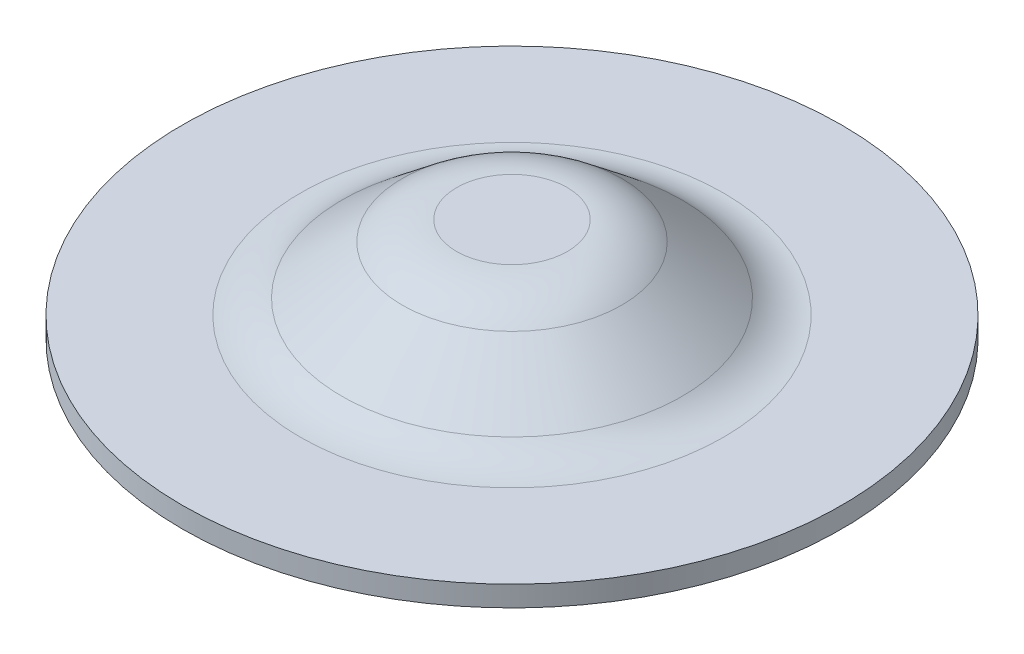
ISO-10303-21;
HEADER;
FILE_DESCRIPTION(('STEP AP214'),'2;1');
FILE_NAME('part.step','',(''),(''),'','','');
FILE_SCHEMA(('AUTOMOTIVE_DESIGN { 1 0 10303 214 1 1 1 1 }'));
ENDSEC;
DATA;
#1=APPLICATION_CONTEXT('core data for automotive mechanical design processes');
#2=APPLICATION_PROTOCOL_DEFINITION('international standard','automotive_design',2000,#1);
#3=PRODUCT_CONTEXT('',#1,'mechanical');
#4=PRODUCT('Part','Part','',(#3));
#5=PRODUCT_RELATED_PRODUCT_CATEGORY('part','',(#4));
#6=PRODUCT_DEFINITION_FORMATION('','',#4);
#7=PRODUCT_DEFINITION_CONTEXT('part definition',#1,'design');
#8=PRODUCT_DEFINITION('design','',#6,#7);
#9=PRODUCT_DEFINITION_SHAPE('','',#8);
#10=(LENGTH_UNIT() NAMED_UNIT(*) SI_UNIT(.MILLI.,.METRE.));
#11=(NAMED_UNIT(*) PLANE_ANGLE_UNIT() SI_UNIT($,.RADIAN.));
#12=(NAMED_UNIT(*) SI_UNIT($,.STERADIAN.) SOLID_ANGLE_UNIT());
#13=UNCERTAINTY_MEASURE_WITH_UNIT(LENGTH_MEASURE(1.E-05),#10,'distance_accuracy_value','');
#14=(GEOMETRIC_REPRESENTATION_CONTEXT(3) GLOBAL_UNCERTAINTY_ASSIGNED_CONTEXT((#13)) GLOBAL_UNIT_ASSIGNED_CONTEXT((#10,
#11,#12)) REPRESENTATION_CONTEXT('',''));
#15=CARTESIAN_POINT('',(0.,0.,0.));
#16=DIRECTION('',(0.,0.,1.));
#17=DIRECTION('',(1.,0.,0.));
#18=AXIS2_PLACEMENT_3D('',#15,#16,#17);
#19=CARTESIAN_POINT('',(0.,0.,0.));
#20=DIRECTION('',(0.,-1.,0.));
#21=DIRECTION('',(0.,0.,-1.));
#22=AXIS2_PLACEMENT_3D('',#19,#20,#21);
#23=PLANE('',#22);
#24=CARTESIAN_POINT('',(0.,0.,-2.667));
#25=CARTESIAN_POINT('',(0.0290924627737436,0.,-2.66700018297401));
#26=CARTESIAN_POINT('',(0.058184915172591,0.,-2.6665239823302));
#27=CARTESIAN_POINT('',(0.116338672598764,0.,-2.66462012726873));
#28=CARTESIAN_POINT('',(0.145399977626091,0.,-2.66319247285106));
#29=CARTESIAN_POINT('',(0.203460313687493,0.,-2.65938702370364));
#30=CARTESIAN_POINT('',(0.23245934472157,0.,-2.65700922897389));
#31=CARTESIAN_POINT('',(0.290364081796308,0.,-2.65130610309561));
#32=CARTESIAN_POINT('',(0.31926978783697,0.,-2.64798077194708));
#33=CARTESIAN_POINT('',(0.376956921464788,0.,-2.64038611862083));
#34=CARTESIAN_POINT('',(0.405738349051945,0.,-2.63611679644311));
#35=CARTESIAN_POINT('',(0.463146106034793,0.,-2.62663873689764));
#36=CARTESIAN_POINT('',(0.491772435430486,0.,-2.62142999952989));
#37=CARTESIAN_POINT('',(0.548839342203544,0.,-2.61007868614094));
#38=CARTESIAN_POINT('',(0.57727991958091,0.,-2.60393611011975));
#39=CARTESIAN_POINT('',(0.633944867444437,0.,-2.59072369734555));
#40=CARTESIAN_POINT('',(0.662169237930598,0.,-2.58365386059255));
#41=CARTESIAN_POINT('',(0.718371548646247,0.,-2.56859449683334));
#42=CARTESIAN_POINT('',(0.746349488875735,0.,-2.56060496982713));
#43=CARTESIAN_POINT('',(0.802028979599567,0.,-2.54371478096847));
#44=CARTESIAN_POINT('',(0.82973053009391,0.,-2.53481411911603));
#45=CARTESIAN_POINT('',(0.88482757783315,0.,-2.51611119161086));
#46=CARTESIAN_POINT('',(0.912223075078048,0.,-2.50630892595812));
#47=CARTESIAN_POINT('',(0.966678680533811,0.,-2.48581328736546));
#48=CARTESIAN_POINT('',(0.993738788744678,0.,-2.47511991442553));
#49=CARTESIAN_POINT('',(1.04749463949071,0.,-2.45285351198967));
#50=CARTESIAN_POINT('',(1.07419038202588,0.,-2.44128048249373));
#51=CARTESIAN_POINT('',(1.12718891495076,0.,-2.41726715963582));
#52=CARTESIAN_POINT('',(1.15349170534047,0.,-2.40482686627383));
#53=CARTESIAN_POINT('',(1.20567616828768,0.,-2.37909233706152));
#54=CARTESIAN_POINT('',(1.23155784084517,0.,-2.36579810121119));
#55=CARTESIAN_POINT('',(1.2828723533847,0.,-2.33836992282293));
#56=CARTESIAN_POINT('',(1.30830519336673,0.,-2.32423598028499));
#57=CARTESIAN_POINT('',(1.35869480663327,0.,-2.2951435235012));
#58=CARTESIAN_POINT('',(1.38365157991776,0.,-2.28018500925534));
#59=CARTESIAN_POINT('',(1.4330623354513,0.,-2.24945942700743));
#60=CARTESIAN_POINT('',(1.45751631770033,0.,-2.23369235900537));
#61=CARTESIAN_POINT('',(1.50589530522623,0.,-2.2013665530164));
#62=CARTESIAN_POINT('',(1.5298203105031,0.,-2.18480781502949));
#63=CARTESIAN_POINT('',(1.57711572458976,0.,-2.15091640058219));
#64=CARTESIAN_POINT('',(1.60048613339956,0.,-2.1335837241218));
#65=CARTESIAN_POINT('',(1.64664732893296,0.,-2.09816299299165));
#66=CARTESIAN_POINT('',(1.66943811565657,0.,-2.08007493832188));
#67=CARTESIAN_POINT('',(1.71441566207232,0.,-2.04316281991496));
#68=CARTESIAN_POINT('',(1.73660242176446,0.,-2.02433875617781));
#69=CARTESIAN_POINT('',(1.7803481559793,0.,-1.98597477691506));
#70=CARTESIAN_POINT('',(1.80190713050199,0.,-1.96643486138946));
#71=CARTESIAN_POINT('',(1.844374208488,0.,-1.92666010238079));
#72=CARTESIAN_POINT('',(1.86528231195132,0.,-1.90642525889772));
#73=CARTESIAN_POINT('',(1.90642525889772,0.,-1.86528231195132));
#74=CARTESIAN_POINT('',(1.92666010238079,0.,-1.844374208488));
#75=CARTESIAN_POINT('',(1.96643486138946,0.,-1.80190713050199));
#76=CARTESIAN_POINT('',(1.98597477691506,0.,-1.7803481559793));
#77=CARTESIAN_POINT('',(2.02433875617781,0.,-1.73660242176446));
#78=CARTESIAN_POINT('',(2.04316281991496,0.,-1.71441566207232));
#79=CARTESIAN_POINT('',(2.08007493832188,0.,-1.66943811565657));
#80=CARTESIAN_POINT('',(2.09816299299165,0.,-1.64664732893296));
#81=CARTESIAN_POINT('',(2.1335837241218,0.,-1.60048613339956));
#82=CARTESIAN_POINT('',(2.15091640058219,0.,-1.57711572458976));
#83=CARTESIAN_POINT('',(2.18480781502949,0.,-1.5298203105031));
#84=CARTESIAN_POINT('',(2.2013665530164,0.,-1.50589530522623));
#85=CARTESIAN_POINT('',(2.23369235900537,0.,-1.45751631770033));
#86=CARTESIAN_POINT('',(2.24945942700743,0.,-1.4330623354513));
#87=CARTESIAN_POINT('',(2.28018500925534,0.,-1.38365157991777));
#88=CARTESIAN_POINT('',(2.2951435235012,0.,-1.35869480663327));
#89=CARTESIAN_POINT('',(2.32423598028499,0.,-1.30830519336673));
#90=CARTESIAN_POINT('',(2.33836992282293,0.,-1.2828723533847));
#91=CARTESIAN_POINT('',(2.36579810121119,0.,-1.23155784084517));
#92=CARTESIAN_POINT('',(2.37909233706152,0.,-1.20567616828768));
#93=CARTESIAN_POINT('',(2.40482686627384,0.,-1.15349170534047));
#94=CARTESIAN_POINT('',(2.41726715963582,0.,-1.12718891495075));
#95=CARTESIAN_POINT('',(2.44128048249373,0.,-1.07419038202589));
#96=CARTESIAN_POINT('',(2.45285351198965,0.,-1.04749463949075));
#97=CARTESIAN_POINT('',(2.47511991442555,0.,-0.993738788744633));
#98=CARTESIAN_POINT('',(2.48581328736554,0.,-0.966678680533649));
#99=CARTESIAN_POINT('',(2.50630892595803,0.,-0.912223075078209));
#100=CARTESIAN_POINT('',(2.51611119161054,0.,-0.884827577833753));
#101=CARTESIAN_POINT('',(2.53481411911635,0.,-0.829730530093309));
#102=CARTESIAN_POINT('',(2.54371478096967,0.,-0.802028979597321));
#103=CARTESIAN_POINT('',(2.56060496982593,0.,-0.74634948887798));
#104=CARTESIAN_POINT('',(2.56859449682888,0.,-0.718371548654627));
#105=CARTESIAN_POINT('',(2.58365386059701,0.,-0.662169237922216));
#106=CARTESIAN_POINT('',(2.59072369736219,0.,-0.633944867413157));
#107=CARTESIAN_POINT('',(2.6039361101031,0.,-0.577279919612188));
#108=CARTESIAN_POINT('',(2.61007868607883,0.,-0.548839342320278));
#109=CARTESIAN_POINT('',(2.62142999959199,0.,-0.49177243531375));
#110=CARTESIAN_POINT('',(2.62663873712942,0.,-0.463146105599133));
#111=CARTESIAN_POINT('',(2.63611679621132,0.,-0.405738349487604));
#112=CARTESIAN_POINT('',(2.64038611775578,0.,-0.376956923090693));
#113=CARTESIAN_POINT('',(2.64798077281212,0.,-0.319269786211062));
#114=CARTESIAN_POINT('',(2.651306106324,0.,-0.290364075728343));
#115=CARTESIAN_POINT('',(2.6570092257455,0.,-0.232459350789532));
#116=CARTESIAN_POINT('',(2.65938701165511,0.,-0.203460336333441));
#117=CARTESIAN_POINT('',(2.6631924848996,0.,-0.145399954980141));
#118=CARTESIAN_POINT('',(2.66462017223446,0.,-0.116338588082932));
#119=CARTESIAN_POINT('',(2.66652393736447,0.,-0.0581849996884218));
#120=CARTESIAN_POINT('',(2.66700001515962,0.,-0.0290927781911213));
#121=CARTESIAN_POINT('',(2.66699998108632,0.,0.0362971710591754));
#122=CARTESIAN_POINT('',(2.66625887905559,0.,0.0725952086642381));
#123=CARTESIAN_POINT('',(2.66329566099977,0.,0.145130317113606));
#124=CARTESIAN_POINT('',(2.66107354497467,0.,0.181367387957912));
#125=CARTESIAN_POINT('',(2.65515202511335,0.,0.253720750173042));
#126=CARTESIAN_POINT('',(2.65145262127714,0.,0.289837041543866));
#127=CARTESIAN_POINT('',(2.64258268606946,0.,0.361888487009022));
#128=CARTESIAN_POINT('',(2.63741215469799,0.,0.397823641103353));
#129=CARTESIAN_POINT('',(2.62560858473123,0.,0.46945295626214));
#130=CARTESIAN_POINT('',(2.61897554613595,0.,0.505147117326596));
#131=CARTESIAN_POINT('',(2.60425801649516,0.,0.576234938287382));
#132=CARTESIAN_POINT('',(2.59617352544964,0.,0.611628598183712));
#133=CARTESIAN_POINT('',(2.57856657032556,0.,0.682056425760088));
#134=CARTESIAN_POINT('',(2.569044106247,0.,0.717090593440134));
#135=CARTESIAN_POINT('',(2.54857706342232,0.,0.786741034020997));
#136=CARTESIAN_POINT('',(2.5376324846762,0.,0.821357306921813));
#137=CARTESIAN_POINT('',(2.51433950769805,0.,0.890114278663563));
#138=CARTESIAN_POINT('',(2.50199110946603,1.35107511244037E-13,0.924254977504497));
#139=CARTESIAN_POINT('',(2.47591088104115,-1.35107511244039E-13,0.992003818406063));
#140=CARTESIAN_POINT('',(2.46217905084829,-5.04228096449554E-13,1.0256119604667));
#141=CARTESIAN_POINT('',(2.43335557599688,5.04228096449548E-13,1.09223995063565));
#142=CARTESIAN_POINT('',(2.41826393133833,1.88180487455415E-12,1.12525979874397));
#143=CARTESIAN_POINT('',(2.38674326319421,-1.88180487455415E-12,1.19065510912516));
#144=CARTESIAN_POINT('',(2.37031423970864,-7.02299140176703E-12,1.22303057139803));
#145=CARTESIAN_POINT('',(2.33799702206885,6.2660925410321E-12,1.28363524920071));
#146=CARTESIAN_POINT('',(2.32224136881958,2.22156793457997E-11,1.31193527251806));
#147=CARTESIAN_POINT('',(2.28972351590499,-1.33273926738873E-10,1.36795181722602));
#148=CARTESIAN_POINT('',(2.27296130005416,-3.04716133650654E-10,1.39566832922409));
#149=CARTESIAN_POINT('',(2.23844942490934,-1.47221820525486E-09,1.45048081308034));
#150=CARTESIAN_POINT('',(2.22069973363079,-2.46830479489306E-09,1.47757676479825));
#151=CARTESIAN_POINT('',(2.1842366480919,-6.52742647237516E-09,1.53111428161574));
#152=CARTESIAN_POINT('',(2.16552320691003,-9.59056228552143E-09,1.55755581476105));
#153=CARTESIAN_POINT('',(2.12715429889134,-1.88403835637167E-08,1.60974885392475));
#154=CARTESIAN_POINT('',(2.10749877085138,-2.50272722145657E-08,1.63550031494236));
#155=CARTESIAN_POINT('',(2.06727819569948,-4.43842684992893E-08,1.68628643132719));
#156=CARTESIAN_POINT('',(2.04671307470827,-5.75549443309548E-08,1.71132102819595));
#157=CARTESIAN_POINT('',(2.00465330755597,-8.63891432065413E-08,1.76063955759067));
#158=CARTESIAN_POINT('',(1.9831577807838,-1.02055067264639E-07,1.78492273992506));
#159=CARTESIAN_POINT('',(1.93925780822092,-1.22925110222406E-07,1.83265526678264));
#160=CARTESIAN_POINT('',(1.91685332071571,-1.2812874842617E-07,1.85610457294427));
#161=CARTESIAN_POINT('',(1.87117685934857,-1.27898711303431E-07,1.90214258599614));
#162=CARTESIAN_POINT('',(1.84790488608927,-1.22465043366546E-07,1.92473129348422));
#163=CARTESIAN_POINT('',(1.80052158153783,-1.0258622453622E-07,1.96900756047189));
#164=CARTESIAN_POINT('',(1.7764102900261,-8.81415001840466E-08,1.99069516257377));
#165=CARTESIAN_POINT('',(1.72740022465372,-5.59039025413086E-08,2.03315840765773));
#166=CARTESIAN_POINT('',(1.70250152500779,-3.81113440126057E-08,2.05393413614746));
#167=CARTESIAN_POINT('',(1.65189467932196,-1.09082684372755E-08,2.0944660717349));
#168=CARTESIAN_POINT('',(1.62618664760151,-1.49657303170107E-09,2.11422242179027));
#169=CARTESIAN_POINT('',(1.58981000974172,5.98360337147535E-10,2.14134754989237));
#170=CARTESIAN_POINT('',(1.57937548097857,-6.8561531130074E-11,2.14903455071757));
#171=CARTESIAN_POINT('',(1.54534522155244,-1.49000651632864E-09,2.1737407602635));
#172=CARTESIAN_POINT('',(1.52153466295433,-1.32020493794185E-09,2.19046575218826));
#173=CARTESIAN_POINT('',(1.46002795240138,-1.26088254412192E-09,2.23218650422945));
#174=CARTESIAN_POINT('',(1.42195242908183,-1.57895459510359E-09,2.25662666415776));
#175=CARTESIAN_POINT('',(1.35877836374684,-1.68112975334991E-09,2.29495250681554));
#176=CARTESIAN_POINT('',(1.33403349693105,-1.61811451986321E-09,2.30942584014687));
#177=CARTESIAN_POINT('',(1.28057594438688,-1.47565240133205E-09,2.33954900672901));
#178=CARTESIAN_POINT('',(1.25179485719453,-1.39514106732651E-09,2.35507784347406));
#179=CARTESIAN_POINT('',(1.19009763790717,-1.18671461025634E-09,2.38691760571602));
#180=CARTESIAN_POINT('',(1.15710934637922,-1.05417734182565E-09,2.40308873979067));
#181=CARTESIAN_POINT('',(1.08683539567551,-7.78135616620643E-10,2.43575618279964));
#182=CARTESIAN_POINT('',(1.04947559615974,-6.35024852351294E-10,2.45209323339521));
#183=CARTESIAN_POINT('',(0.97031551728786,-3.65540193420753E-10,2.48456947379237));
#184=CARTESIAN_POINT('',(0.928441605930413,-2.42223011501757E-10,2.5005291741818));
#185=CARTESIAN_POINT('',(0.840135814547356,-5.6280984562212E-11,2.53166257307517));
#186=CARTESIAN_POINT('',(0.793632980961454,-1.19681284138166E-13,2.54663615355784));
#187=CARTESIAN_POINT('',(0.726577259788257,0.,2.56621204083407));
#188=CARTESIAN_POINT('',(0.706325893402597,-1.02871798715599E-11,2.5718649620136));
#189=CARTESIAN_POINT('',(0.665694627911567,-4.21119574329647E-11,2.58268942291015));
#190=CARTESIAN_POINT('',(0.645314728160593,-6.35980783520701E-11,2.5878609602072));
#191=CARTESIAN_POINT('',(0.58400014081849,-1.32626883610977E-10,2.6026490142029));
#192=CARTESIAN_POINT('',(0.542887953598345,-1.84742196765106E-10,2.6115397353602));
#193=CARTESIAN_POINT('',(0.460290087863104,-2.58693171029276E-10,2.62736347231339));
#194=CARTESIAN_POINT('',(0.418804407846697,-2.80528710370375E-10,2.63429648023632));
#195=CARTESIAN_POINT('',(0.335550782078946,-2.80694232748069E-10,2.64618984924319));
#196=CARTESIAN_POINT('',(0.293782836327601,-2.59024215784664E-10,2.65115021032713));
#197=CARTESIAN_POINT('',(0.210059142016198,-1.84411153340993E-10,2.65908672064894));
#198=CARTESIAN_POINT('',(0.16810339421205,-1.31468233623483E-10,2.6620628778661));
#199=CARTESIAN_POINT('',(0.0840983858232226,-4.17494704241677E-11,2.66602527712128));
#200=CARTESIAN_POINT('',(0.0420491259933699,-4.97349691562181E-12,2.66701153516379));
#201=CARTESIAN_POINT('',(0.,0.,2.667));
#202=B_SPLINE_CURVE_WITH_KNOTS('',3,(#24,#25,#26,#27,#28,#29,#30,#31,#32,#33,#34,#35,#36,#37,
#38,#39,#40,#41,#42,#43,#44,#45,#46,#47,#48,#49,#50,#51,#52,#53,#54,#55,#56,#57,#58,#59,#60,#61,
#62,#63,#64,#65,#66,#67,#68,#69,#70,#71,#72,#73,#74,#75,#76,#77,#78,#79,#80,#81,#82,#83,#84,#85,
#86,#87,#88,#89,#90,#91,#92,#93,#94,#95,#96,#97,#98,#99,#100,#101,#102,#103,#104,#105,#106,#107,
#108,#109,#110,#111,#112,#113,#114,#115,#116,#117,#118,#119,#120,#121,#122,#123,#124,#125,#126,
#127,#128,#129,#130,#131,#132,#133,#134,#135,#136,#137,#138,#139,#140,#141,#142,#143,#144,#145,
#146,#147,#148,#149,#150,#151,#152,#153,#154,#155,#156,#157,#158,#159,#160,#161,#162,#163,#164,
#165,#166,#167,#168,#169,#170,#171,#172,#173,#174,#175,#176,#177,#178,#179,#180,#181,#182,#183,
#184,#185,#186,#187,#188,#189,#190,#191,#192,#193,#194,#195,#196,#197,#198,#199,#200,#201),
.UNSPECIFIED.,.F.,.F.,(4,2,2,2,2,2,2,2,2,2,2,2,2,2,2,2,2,2,2,2,2,2,2,2,2,2,2,2,2,2,2,2,2,2,2,2,
2,2,2,2,2,2,2,2,2,2,2,2,2,2,2,2,2,2,2,2,2,2,2,2,2,2,2,2,2,2,2,2,2,2,2,2,2,2,2,2,2,2,2,2,2,2,2,2,
2,2,2,2,4),(0.,0.087273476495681,0.174546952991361,0.261820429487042,0.349093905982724,
0.436367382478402,0.523640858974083,0.610914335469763,0.698187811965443,0.785461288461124,
0.872734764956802,0.960008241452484,1.04728171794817,1.13455519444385,1.22182867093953,
1.30910214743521,1.39637562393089,1.48364910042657,1.57092257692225,1.65819605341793,
1.74546952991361,1.83274300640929,1.92001648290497,2.00728995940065,2.09456343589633,
2.18183691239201,2.26911038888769,2.35638386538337,2.44365734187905,2.53093081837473,
2.61820429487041,2.70547777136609,2.79275124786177,2.88002472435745,2.96729820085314,
3.05457167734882,3.1418451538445,3.22911863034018,3.31639210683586,3.40366558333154,
3.49093905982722,3.5782125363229,3.66548601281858,3.75275948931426,3.84003296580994,
3.92730644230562,4.0145799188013,4.10185339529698,4.18912687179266,4.29801232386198,
4.4068977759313,4.51578322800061,4.62466868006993,4.73355413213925,4.84243958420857,
4.95132503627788,5.0602104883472,5.16909594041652,5.27798139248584,5.38686684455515,
5.49575229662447,5.59290268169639,5.6900546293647,5.78720972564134,5.88436955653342,
5.98153570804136,6.07870976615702,6.17597789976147,6.27325050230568,6.37052303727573,
6.46779096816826,6.56504975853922,6.66229487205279,6.70117544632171,6.78845350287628,
6.92412132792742,7.01010918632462,7.10819579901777,7.2183809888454,7.34066460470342,
7.4750465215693,7.62152664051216,7.68459858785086,7.74767085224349,7.87380722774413,
7.99994411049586,8.12608099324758,8.25221736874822,8.37835272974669),.UNSPECIFIED.);
#203=CARTESIAN_POINT('',(0.,0.,-2.667));
#204=VERTEX_POINT('',#203);
#205=CARTESIAN_POINT('',(0.,0.,2.667));
#206=VERTEX_POINT('',#205);
#207=EDGE_CURVE('E52',#204,#206,#202,.T.);
#208=ORIENTED_EDGE('',*,*,#207,.F.);
#209=CARTESIAN_POINT('',(0.,0.,2.667));
#210=CARTESIAN_POINT('',(-0.0290924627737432,0.,2.66700018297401));
#211=CARTESIAN_POINT('',(-0.0581849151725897,0.,2.6665239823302));
#212=CARTESIAN_POINT('',(-0.116338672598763,0.,2.66462012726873));
#213=CARTESIAN_POINT('',(-0.145399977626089,0.,2.66319247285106));
#214=CARTESIAN_POINT('',(-0.203460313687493,0.,2.65938702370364));
#215=CARTESIAN_POINT('',(-0.23245934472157,0.,2.65700922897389));
#216=CARTESIAN_POINT('',(-0.290364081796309,0.,2.65130610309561));
#217=CARTESIAN_POINT('',(-0.319269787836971,0.,2.64798077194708));
#218=CARTESIAN_POINT('',(-0.376956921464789,0.,2.64038611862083));
#219=CARTESIAN_POINT('',(-0.405738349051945,0.,2.63611679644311));
#220=CARTESIAN_POINT('',(-0.463146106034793,0.,2.62663873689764));
#221=CARTESIAN_POINT('',(-0.491772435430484,0.,2.62142999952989));
#222=CARTESIAN_POINT('',(-0.548839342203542,0.,2.61007868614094));
#223=CARTESIAN_POINT('',(-0.577279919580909,0.,2.60393611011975));
#224=CARTESIAN_POINT('',(-0.633944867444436,0.,2.59072369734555));
#225=CARTESIAN_POINT('',(-0.662169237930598,0.,2.58365386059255));
#226=CARTESIAN_POINT('',(-0.718371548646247,0.,2.56859449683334));
#227=CARTESIAN_POINT('',(-0.746349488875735,0.,2.56060496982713));
#228=CARTESIAN_POINT('',(-0.802028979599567,0.,2.54371478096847));
#229=CARTESIAN_POINT('',(-0.82973053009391,0.,2.53481411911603));
#230=CARTESIAN_POINT('',(-0.884827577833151,0.,2.51611119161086));
#231=CARTESIAN_POINT('',(-0.912223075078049,0.,2.50630892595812));
#232=CARTESIAN_POINT('',(-0.966678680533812,0.,2.48581328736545));
#233=CARTESIAN_POINT('',(-0.993738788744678,0.,2.47511991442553));
#234=CARTESIAN_POINT('',(-1.04749463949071,0.,2.45285351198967));
#235=CARTESIAN_POINT('',(-1.07419038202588,0.,2.44128048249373));
#236=CARTESIAN_POINT('',(-1.12718891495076,0.,2.41726715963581));
#237=CARTESIAN_POINT('',(-1.15349170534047,0.,2.40482686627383));
#238=CARTESIAN_POINT('',(-1.20567616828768,0.,2.37909233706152));
#239=CARTESIAN_POINT('',(-1.23155784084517,0.,2.36579810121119));
#240=CARTESIAN_POINT('',(-1.2828723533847,0.,2.33836992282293));
#241=CARTESIAN_POINT('',(-1.30830519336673,0.,2.32423598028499));
#242=CARTESIAN_POINT('',(-1.35869480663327,0.,2.2951435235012));
#243=CARTESIAN_POINT('',(-1.38365157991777,0.,2.28018500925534));
#244=CARTESIAN_POINT('',(-1.4330623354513,0.,2.24945942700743));
#245=CARTESIAN_POINT('',(-1.45751631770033,0.,2.23369235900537));
#246=CARTESIAN_POINT('',(-1.50589530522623,0.,2.2013665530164));
#247=CARTESIAN_POINT('',(-1.5298203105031,0.,2.18480781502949));
#248=CARTESIAN_POINT('',(-1.57711572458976,0.,2.15091640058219));
#249=CARTESIAN_POINT('',(-1.60048613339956,0.,2.1335837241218));
#250=CARTESIAN_POINT('',(-1.64664732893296,0.,2.09816299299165));
#251=CARTESIAN_POINT('',(-1.66943811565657,0.,2.08007493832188));
#252=CARTESIAN_POINT('',(-1.71441566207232,0.,2.04316281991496));
#253=CARTESIAN_POINT('',(-1.73660242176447,0.,2.0243387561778));
#254=CARTESIAN_POINT('',(-1.7803481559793,0.,1.98597477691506));
#255=CARTESIAN_POINT('',(-1.80190713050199,0.,1.96643486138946));
#256=CARTESIAN_POINT('',(-1.844374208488,0.,1.92666010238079));
#257=CARTESIAN_POINT('',(-1.86528231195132,0.,1.90642525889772));
#258=CARTESIAN_POINT('',(-1.90642525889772,0.,1.86528231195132));
#259=CARTESIAN_POINT('',(-1.92666010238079,0.,1.844374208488));
#260=CARTESIAN_POINT('',(-1.96643486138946,0.,1.80190713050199));
#261=CARTESIAN_POINT('',(-1.98597477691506,0.,1.7803481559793));
#262=CARTESIAN_POINT('',(-2.02433875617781,0.,1.73660242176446));
#263=CARTESIAN_POINT('',(-2.04316281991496,0.,1.71441566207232));
#264=CARTESIAN_POINT('',(-2.08007493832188,0.,1.66943811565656));
#265=CARTESIAN_POINT('',(-2.09816299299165,0.,1.64664732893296));
#266=CARTESIAN_POINT('',(-2.1335837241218,0.,1.60048613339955));
#267=CARTESIAN_POINT('',(-2.15091640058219,0.,1.57711572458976));
#268=CARTESIAN_POINT('',(-2.18480781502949,0.,1.52982031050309));
#269=CARTESIAN_POINT('',(-2.2013665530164,0.,1.50589530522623));
#270=CARTESIAN_POINT('',(-2.23369235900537,0.,1.45751631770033));
#271=CARTESIAN_POINT('',(-2.24945942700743,0.,1.4330623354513));
#272=CARTESIAN_POINT('',(-2.28018500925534,0.,1.38365157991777));
#273=CARTESIAN_POINT('',(-2.2951435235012,0.,1.35869480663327));
#274=CARTESIAN_POINT('',(-2.32423598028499,0.,1.30830519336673));
#275=CARTESIAN_POINT('',(-2.33836992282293,0.,1.2828723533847));
#276=CARTESIAN_POINT('',(-2.36579810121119,0.,1.23155784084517));
#277=CARTESIAN_POINT('',(-2.37909233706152,0.,1.20567616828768));
#278=CARTESIAN_POINT('',(-2.40482686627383,0.,1.15349170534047));
#279=CARTESIAN_POINT('',(-2.41726715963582,0.,1.12718891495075));
#280=CARTESIAN_POINT('',(-2.44128048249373,0.,1.07419038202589));
#281=CARTESIAN_POINT('',(-2.45285351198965,0.,1.04749463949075));
#282=CARTESIAN_POINT('',(-2.47511991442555,0.,0.993738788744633));
#283=CARTESIAN_POINT('',(-2.48581328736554,0.,0.966678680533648));
#284=CARTESIAN_POINT('',(-2.50630892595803,0.,0.912223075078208));
#285=CARTESIAN_POINT('',(-2.51611119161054,0.,0.884827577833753));
#286=CARTESIAN_POINT('',(-2.53481411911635,0.,0.829730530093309));
#287=CARTESIAN_POINT('',(-2.54371478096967,0.,0.80202897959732));
#288=CARTESIAN_POINT('',(-2.56060496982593,0.,0.746349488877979));
#289=CARTESIAN_POINT('',(-2.56859449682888,0.,0.718371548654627));
#290=CARTESIAN_POINT('',(-2.58365386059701,0.,0.662169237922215));
#291=CARTESIAN_POINT('',(-2.59072369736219,0.,0.633944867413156));
#292=CARTESIAN_POINT('',(-2.6039361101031,0.,0.577279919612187));
#293=CARTESIAN_POINT('',(-2.61007868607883,0.,0.548839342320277));
#294=CARTESIAN_POINT('',(-2.62142999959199,0.,0.49177243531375));
#295=CARTESIAN_POINT('',(-2.62663873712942,0.,0.463146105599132));
#296=CARTESIAN_POINT('',(-2.63611679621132,0.,0.405738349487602));
#297=CARTESIAN_POINT('',(-2.64038611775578,0.,0.37695692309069));
#298=CARTESIAN_POINT('',(-2.64798077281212,0.,0.31926978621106));
#299=CARTESIAN_POINT('',(-2.651306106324,0.,0.290364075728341));
#300=CARTESIAN_POINT('',(-2.65700922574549,0.,0.232459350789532));
#301=CARTESIAN_POINT('',(-2.65938701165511,0.,0.203460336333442));
#302=CARTESIAN_POINT('',(-2.66319248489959,0.,0.145399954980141));
#303=CARTESIAN_POINT('',(-2.66462017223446,0.,0.11633858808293));
#304=CARTESIAN_POINT('',(-2.66652393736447,0.,0.0581849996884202));
#305=CARTESIAN_POINT('',(-2.66700001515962,0.,0.0290927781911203));
#306=CARTESIAN_POINT('',(-2.66699998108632,0.,-0.0362971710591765));
#307=CARTESIAN_POINT('',(-2.66625887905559,0.,-0.07259520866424));
#308=CARTESIAN_POINT('',(-2.66329566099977,0.,-0.145130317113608));
#309=CARTESIAN_POINT('',(-2.66107354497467,0.,-0.181367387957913));
#310=CARTESIAN_POINT('',(-2.65515202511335,0.,-0.253720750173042));
#311=CARTESIAN_POINT('',(-2.65145262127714,0.,-0.289837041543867));
#312=CARTESIAN_POINT('',(-2.64258268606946,0.,-0.361888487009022));
#313=CARTESIAN_POINT('',(-2.63741215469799,0.,-0.397823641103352));
#314=CARTESIAN_POINT('',(-2.62560858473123,0.,-0.46945295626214));
#315=CARTESIAN_POINT('',(-2.61897554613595,0.,-0.505147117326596));
#316=CARTESIAN_POINT('',(-2.60425801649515,0.,-0.576234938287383));
#317=CARTESIAN_POINT('',(-2.59617352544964,0.,-0.611628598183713));
#318=CARTESIAN_POINT('',(-2.57856657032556,0.,-0.682056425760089));
#319=CARTESIAN_POINT('',(-2.569044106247,0.,-0.717090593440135));
#320=CARTESIAN_POINT('',(-2.54857706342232,0.,-0.786741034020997));
#321=CARTESIAN_POINT('',(-2.5376324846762,0.,-0.821357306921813));
#322=CARTESIAN_POINT('',(-2.51433950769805,0.,-0.890114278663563));
#323=CARTESIAN_POINT('',(-2.50199110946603,1.3510753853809E-13,-0.924254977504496));
#324=CARTESIAN_POINT('',(-2.47591088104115,-1.35107538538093E-13,-0.992003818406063));
#325=CARTESIAN_POINT('',(-2.46217905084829,-5.04228198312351E-13,-1.0256119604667));
#326=CARTESIAN_POINT('',(-2.43335557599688,5.04228198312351E-13,-1.09223995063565));
#327=CARTESIAN_POINT('',(-2.41826393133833,1.88180525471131E-12,-1.12525979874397));
#328=CARTESIAN_POINT('',(-2.38674326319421,-1.88180525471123E-12,-1.19065510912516));
#329=CARTESIAN_POINT('',(-2.37031423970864,-7.02299282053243E-12,-1.22303057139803));
#330=CARTESIAN_POINT('',(-2.33799702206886,6.26609380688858E-12,-1.2836352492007));
#331=CARTESIAN_POINT('',(-2.32224136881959,2.22156838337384E-11,-1.31193527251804));
#332=CARTESIAN_POINT('',(-2.28972351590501,-1.33273931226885E-10,-1.36795181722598));
#333=CARTESIAN_POINT('',(-2.27296130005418,-3.04716150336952E-10,-1.39566832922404));
#334=CARTESIAN_POINT('',(-2.23844942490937,-1.47221818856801E-09,-1.45048081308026));
#335=CARTESIAN_POINT('',(-2.22069973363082,-2.46830473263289E-09,-1.47757676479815));
#336=CARTESIAN_POINT('',(-2.18423664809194,-6.52742653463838E-09,-1.53111428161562));
#337=CARTESIAN_POINT('',(-2.16552320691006,-9.59056251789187E-09,-1.55755581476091));
#338=CARTESIAN_POINT('',(-2.12715429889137,-1.8840383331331E-08,-1.60974885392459));
#339=CARTESIAN_POINT('',(-2.10749877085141,-2.50272713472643E-08,-1.63550031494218));
#340=CARTESIAN_POINT('',(-2.06727819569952,-4.43842676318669E-08,-1.68628643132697));
#341=CARTESIAN_POINT('',(-2.04671307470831,-5.75549440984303E-08,-1.71132102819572));
#342=CARTESIAN_POINT('',(-2.00465330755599,-8.63891434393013E-08,-1.76063955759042));
#343=CARTESIAN_POINT('',(-1.98315778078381,-1.02055067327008E-07,-1.78492273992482));
#344=CARTESIAN_POINT('',(-1.93925780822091,-1.22925110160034E-07,-1.8326552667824));
#345=CARTESIAN_POINT('',(-1.9168533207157,-1.28128748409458E-07,-1.85610457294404));
#346=CARTESIAN_POINT('',(-1.87117685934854,-1.27898711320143E-07,-1.90214258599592));
#347=CARTESIAN_POINT('',(-1.84790488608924,-1.22465043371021E-07,-1.92473129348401));
#348=CARTESIAN_POINT('',(-1.8005215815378,-1.02586224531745E-07,-1.96900756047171));
#349=CARTESIAN_POINT('',(-1.77641029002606,-8.81415001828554E-08,-1.9906951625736));
#350=CARTESIAN_POINT('',(-1.72740022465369,-5.59039025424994E-08,-2.0331584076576));
#351=CARTESIAN_POINT('',(-1.70250152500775,-3.81113440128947E-08,-2.05393413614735));
#352=CARTESIAN_POINT('',(-1.65189467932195,-1.09082684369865E-08,-2.09446607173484));
#353=CARTESIAN_POINT('',(-1.62618664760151,-1.49657303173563E-09,-2.11422242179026));
#354=CARTESIAN_POINT('',(-1.58981000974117,5.98360337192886E-10,-2.14134754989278));
#355=CARTESIAN_POINT('',(-1.57937548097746,-6.85615311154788E-11,-2.14903455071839));
#356=CARTESIAN_POINT('',(-1.54534522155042,-1.49000651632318E-09,-2.17374076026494));
#357=CARTESIAN_POINT('',(-1.52153466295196,-1.32020493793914E-09,-2.19046575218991));
#358=CARTESIAN_POINT('',(-1.46002795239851,-1.26088254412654E-09,-2.23218650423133));
#359=CARTESIAN_POINT('',(-1.42195242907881,-1.57895459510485E-09,-2.25662666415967));
#360=CARTESIAN_POINT('',(-1.35877836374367,-1.68112975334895E-09,-2.29495250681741));
#361=CARTESIAN_POINT('',(-1.3340334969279,-1.61811451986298E-09,-2.3094258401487));
#362=CARTESIAN_POINT('',(-1.2805759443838,-1.47565240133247E-09,-2.33954900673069));
#363=CARTESIAN_POINT('',(-1.25179485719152,-1.39514106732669E-09,-2.35507784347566));
#364=CARTESIAN_POINT('',(-1.19009763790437,-1.1867146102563E-09,-2.38691760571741));
#365=CARTESIAN_POINT('',(-1.15710934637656,-1.05417734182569E-09,-2.40308873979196));
#366=CARTESIAN_POINT('',(-1.08683539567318,-7.78135616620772E-10,-2.43575618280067));
#367=CARTESIAN_POINT('',(-1.04947559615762,-6.35024852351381E-10,-2.45209323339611));
#368=CARTESIAN_POINT('',(-0.970315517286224,-3.65540193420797E-10,-2.484569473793));
#369=CARTESIAN_POINT('',(-0.928441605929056,-2.42223011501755E-10,-2.5005291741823));
#370=CARTESIAN_POINT('',(-0.840135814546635,-5.62809845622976E-11,-2.5316625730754));
#371=CARTESIAN_POINT('',(-0.79363298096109,-1.19681284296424E-13,-2.54663615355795));
#372=CARTESIAN_POINT('',(-0.726577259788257,0.,-2.56621204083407));
#373=CARTESIAN_POINT('',(-0.706325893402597,-1.02871798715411E-11,-2.5718649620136));
#374=CARTESIAN_POINT('',(-0.665694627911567,-4.21119574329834E-11,-2.58268942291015));
#375=CARTESIAN_POINT('',(-0.645314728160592,-6.35980783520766E-11,-2.5878609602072));
#376=CARTESIAN_POINT('',(-0.58400014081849,-1.32626883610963E-10,-2.6026490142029));
#377=CARTESIAN_POINT('',(-0.542887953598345,-1.84742196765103E-10,-2.6115397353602));
#378=CARTESIAN_POINT('',(-0.460290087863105,-2.5869317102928E-10,-2.62736347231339));
#379=CARTESIAN_POINT('',(-0.418804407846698,-2.80528710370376E-10,-2.63429648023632));
#380=CARTESIAN_POINT('',(-0.335550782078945,-2.80694232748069E-10,-2.64618984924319));
#381=CARTESIAN_POINT('',(-0.2937828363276,-2.59024215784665E-10,-2.65115021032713));
#382=CARTESIAN_POINT('',(-0.210059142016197,-1.84411153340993E-10,-2.65908672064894));
#383=CARTESIAN_POINT('',(-0.16810339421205,-1.31468233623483E-10,-2.6620628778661));
#384=CARTESIAN_POINT('',(-0.0840983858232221,-4.17494704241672E-11,-2.66602527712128));
#385=CARTESIAN_POINT('',(-0.0420491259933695,-4.97349691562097E-12,-2.66701153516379));
#386=CARTESIAN_POINT('',(0.,0.,-2.667));
#387=B_SPLINE_CURVE_WITH_KNOTS('',3,(#209,#210,#211,#212,#213,#214,#215,#216,#217,#218,#219,
#220,#221,#222,#223,#224,#225,#226,#227,#228,#229,#230,#231,#232,#233,#234,#235,#236,#237,#238,
#239,#240,#241,#242,#243,#244,#245,#246,#247,#248,#249,#250,#251,#252,#253,#254,#255,#256,#257,
#258,#259,#260,#261,#262,#263,#264,#265,#266,#267,#268,#269,#270,#271,#272,#273,#274,#275,#276,
#277,#278,#279,#280,#281,#282,#283,#284,#285,#286,#287,#288,#289,#290,#291,#292,#293,#294,#295,
#296,#297,#298,#299,#300,#301,#302,#303,#304,#305,#306,#307,#308,#309,#310,#311,#312,#313,#314,
#315,#316,#317,#318,#319,#320,#321,#322,#323,#324,#325,#326,#327,#328,#329,#330,#331,#332,#333,
#334,#335,#336,#337,#338,#339,#340,#341,#342,#343,#344,#345,#346,#347,#348,#349,#350,#351,#352,
#353,#354,#355,#356,#357,#358,#359,#360,#361,#362,#363,#364,#365,#366,#367,#368,#369,#370,#371,
#372,#373,#374,#375,#376,#377,#378,#379,#380,#381,#382,#383,#384,#385,#386),.UNSPECIFIED.,.F.,
.F.,(4,2,2,2,2,2,2,2,2,2,2,2,2,2,2,2,2,2,2,2,2,2,2,2,2,2,2,2,2,2,2,2,2,2,2,2,2,2,2,2,2,2,2,2,2,
2,2,2,2,2,2,2,2,2,2,2,2,2,2,2,2,2,2,2,2,2,2,2,2,2,2,2,2,2,2,2,2,2,2,2,2,2,2,2,2,2,2,2,4),(0.,
0.0872734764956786,0.17454695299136,0.261820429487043,0.349093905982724,0.436367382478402,
0.523640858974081,0.610914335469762,0.698187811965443,0.785461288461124,0.872734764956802,
0.960008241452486,1.04728171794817,1.13455519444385,1.22182867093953,1.30910214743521,
1.39637562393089,1.48364910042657,1.57092257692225,1.65819605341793,1.74546952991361,
1.83274300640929,1.92001648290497,2.00728995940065,2.09456343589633,2.18183691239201,
2.26911038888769,2.35638386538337,2.44365734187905,2.53093081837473,2.61820429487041,
2.70547777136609,2.79275124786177,2.88002472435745,2.96729820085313,3.05457167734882,
3.14184515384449,3.22911863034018,3.31639210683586,3.40366558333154,3.49093905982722,
3.5782125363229,3.66548601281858,3.75275948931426,3.84003296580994,3.92730644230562,
4.0145799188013,4.10185339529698,4.18912687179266,4.29801232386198,4.40689777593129,
4.51578322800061,4.62466868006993,4.73355413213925,4.84243958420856,4.95132503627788,
5.0602104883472,5.16909594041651,5.27798139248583,5.38686684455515,5.49575229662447,
5.59290268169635,5.69005462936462,5.78720972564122,5.88436955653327,5.98153570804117,
6.07870976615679,6.17597789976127,6.27325050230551,6.37052303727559,6.46779096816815,
6.56504975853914,6.66229487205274,6.70117544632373,6.78845350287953,6.9241213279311,
7.01010918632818,7.10819579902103,7.21838098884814,7.34066460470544,7.47504652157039,
7.62152664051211,7.68459858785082,7.74767085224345,7.87380722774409,7.99994411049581,
8.12608099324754,8.25221736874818,8.37835272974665),.UNSPECIFIED.);
#388=EDGE_CURVE('E50',#206,#204,#387,.T.);
#389=ORIENTED_EDGE('',*,*,#388,.F.);
#390=EDGE_LOOP('',(#208,#389));
#391=FACE_BOUND('',#390,.T.);
#392=ADVANCED_FACE('F18',(#391),#23,.F.);
#393=CARTESIAN_POINT('',(0.,-4.1656,0.));
#394=DIRECTION('',(0.,1.,0.));
#395=DIRECTION('',(0.,0.,1.));
#396=AXIS2_PLACEMENT_3D('',#393,#394,#395);
#397=DEGENERATE_TOROIDAL_SURFACE('',#396,2.667,4.1656,.T.);
#398=CARTESIAN_POINT('',(0.,-0.928320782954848,0.));
#399=DIRECTION('',(0.,-1.,0.));
#400=DIRECTION('',(1.,0.,0.));
#401=AXIS2_PLACEMENT_3D('',#398,#399,#400);
#402=CIRCLE('',#401,5.28849702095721);
#403=CARTESIAN_POINT('',(5.28849702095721,-0.928320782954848,0.));
#404=VERTEX_POINT('',#403);
#405=EDGE_CURVE('E56',#404,#404,#402,.T.);
#406=ORIENTED_EDGE('',*,*,#405,.F.);
#407=EDGE_LOOP('',(#406));
#408=FACE_BOUND('',#407,.T.);
#409=ORIENTED_EDGE('',*,*,#388,.T.);
#410=ORIENTED_EDGE('',*,*,#207,.T.);
#411=EDGE_LOOP('',(#409,#410));
#412=FACE_BOUND('',#411,.T.);
#413=ADVANCED_FACE('F53',(#408,#412),#397,.T.);
#414=CARTESIAN_POINT('',(0.,-0.9906,0.));
#415=DIRECTION('',(0.,1.,0.));
#416=DIRECTION('',(0.,0.,1.));
#417=AXIS2_PLACEMENT_3D('',#414,#415,#416);
#418=PLANE('',#417);
#419=CARTESIAN_POINT('',(0.,-0.9906,2.667));
#420=CARTESIAN_POINT('',(0.508188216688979,-0.9906,2.667));
#421=CARTESIAN_POINT('',(0.981708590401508,-0.9906,2.4797453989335));
#422=CARTESIAN_POINT('',(1.49440867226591,-0.9906,2.27699710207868));
#423=CARTESIAN_POINT('',(1.88585378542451,-0.9906,1.88585378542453));
#424=CARTESIAN_POINT('',(2.27585877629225,-0.9906,1.49614948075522));
#425=CARTESIAN_POINT('',(2.4797453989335,-0.9906,0.981708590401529));
#426=CARTESIAN_POINT('',(2.66680395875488,-0.9906,0.509727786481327));
#427=CARTESIAN_POINT('',(2.667,-0.9906,0.));
#428=CARTESIAN_POINT('',(2.66719525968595,-0.9906,-0.507695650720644));
#429=CARTESIAN_POINT('',(2.47974539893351,-0.9906,-0.981708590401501));
#430=CARTESIAN_POINT('',(2.27699625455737,-0.9906,-1.49440952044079));
#431=CARTESIAN_POINT('',(1.88585378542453,-0.9906,-1.88585378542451));
#432=CARTESIAN_POINT('',(1.4961494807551,-0.9906,-2.27585877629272));
#433=CARTESIAN_POINT('',(0.981708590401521,-0.9906,-2.4797453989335));
#434=CARTESIAN_POINT('',(0.509233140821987,-0.9906,-2.667));
#435=CARTESIAN_POINT('',(0.,-0.9906,-2.667));
#436=B_SPLINE_CURVE_WITH_KNOTS('',2,(#419,#420,#421,#422,#423,#424,#425,#426,#427,#428,#429,
#430,#431,#432,#433,#434,#435),.UNSPECIFIED.,.F.,.F.,(3,2,2,2,2,2,2,2,3),(0.,0.125,0.25,0.375,
0.5,0.625,0.75,0.875,1.),.UNSPECIFIED.);
#437=CARTESIAN_POINT('',(0.,-0.9906,-2.667));
#438=VERTEX_POINT('',#437);
#439=CARTESIAN_POINT('',(0.,-0.9906,2.667));
#440=VERTEX_POINT('',#439);
#441=EDGE_CURVE('E59',#438,#440,#436,.F.);
#442=ORIENTED_EDGE('',*,*,#441,.T.);
#443=CARTESIAN_POINT('',(0.,-0.9906,-2.667));
#444=CARTESIAN_POINT('',(-0.508188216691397,-0.9906,-2.667));
#445=CARTESIAN_POINT('',(-0.981708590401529,-0.9906,-2.4797453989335));
#446=CARTESIAN_POINT('',(-1.49440867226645,-0.9906,-2.27699710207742));
#447=CARTESIAN_POINT('',(-1.88585378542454,-0.9906,-1.88585378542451));
#448=CARTESIAN_POINT('',(-2.27585877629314,-0.9906,-1.49614948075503));
#449=CARTESIAN_POINT('',(-2.47974539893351,-0.9906,-0.981708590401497));
#450=CARTESIAN_POINT('',(-2.66680395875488,-0.9906,-0.50972778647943));
#451=CARTESIAN_POINT('',(-2.667,-0.9906,0.));
#452=CARTESIAN_POINT('',(-2.66719525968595,-0.9906,0.507695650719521));
#453=CARTESIAN_POINT('',(-2.4797453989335,-0.9906,0.981708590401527));
#454=CARTESIAN_POINT('',(-2.27699625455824,-0.9906,1.4944095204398));
#455=CARTESIAN_POINT('',(-1.88585378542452,-0.9906,1.88585378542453));
#456=CARTESIAN_POINT('',(-1.49614948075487,-0.9906,2.27585877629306));
#457=CARTESIAN_POINT('',(-0.981708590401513,-0.9906,2.4797453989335));
#458=CARTESIAN_POINT('',(-0.509233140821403,-0.9906,2.667));
#459=CARTESIAN_POINT('',(0.,-0.9906,2.667));
#460=B_SPLINE_CURVE_WITH_KNOTS('',2,(#443,#444,#445,#446,#447,#448,#449,#450,#451,#452,#453,
#454,#455,#456,#457,#458,#459),.UNSPECIFIED.,.F.,.F.,(3,2,2,2,2,2,2,2,3),(0.,0.125,0.25,0.375,
0.5,0.625,0.75,0.875,1.),.UNSPECIFIED.);
#461=EDGE_CURVE('E123',#440,#438,#460,.F.);
#462=ORIENTED_EDGE('',*,*,#461,.T.);
#463=EDGE_LOOP('',(#442,#462));
#464=FACE_BOUND('',#463,.T.);
#465=ADVANCED_FACE('F75',(#464),#418,.F.);
#466=CARTESIAN_POINT('',(0.,-3.28023842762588,0.));
#467=DIRECTION('',(0.,-1.,0.));
#468=DIRECTION('',(0.,0.,-1.));
#469=AXIS2_PLACEMENT_3D('',#466,#467,#468);
#470=CONICAL_SURFACE('',#469,8.19287343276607,0.890117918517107);
#471=CARTESIAN_POINT('',(0.,-3.28023842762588,0.));
#472=DIRECTION('',(0.,1.,0.));
#473=DIRECTION('',(0.,0.,-1.));
#474=AXIS2_PLACEMENT_3D('',#471,#472,#473);
#475=CIRCLE('',#474,8.19287343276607);
#476=CARTESIAN_POINT('',(0.,-3.28023842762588,-8.19287343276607));
#477=VERTEX_POINT('',#476);
#478=EDGE_CURVE('E126',#477,#477,#475,.T.);
#479=ORIENTED_EDGE('',*,*,#478,.T.);
#480=EDGE_LOOP('',(#479));
#481=FACE_BOUND('',#480,.T.);
#482=ORIENTED_EDGE('',*,*,#405,.T.);
#483=EDGE_LOOP('',(#482));
#484=FACE_BOUND('',#483,.T.);
#485=ADVANCED_FACE('F82',(#481,#484),#470,.T.);
#486=CARTESIAN_POINT('',(0.,-4.1656,0.));
#487=DIRECTION('',(0.,1.,0.));
#488=DIRECTION('',(0.,0.,1.));
#489=AXIS2_PLACEMENT_3D('',#486,#487,#488);
#490=DEGENERATE_TOROIDAL_SURFACE('',#489,2.667,3.175,.T.);
#491=ORIENTED_EDGE('',*,*,#461,.F.);
#492=ORIENTED_EDGE('',*,*,#441,.F.);
#493=EDGE_LOOP('',(#491,#492));
#494=FACE_BOUND('',#493,.T.);
#495=CARTESIAN_POINT('',(0.,-1.69816157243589,0.));
#496=DIRECTION('',(0.,-1.,0.));
#497=DIRECTION('',(0.,0.,-1.));
#498=AXIS2_PLACEMENT_3D('',#495,#496,#497);
#499=CIRCLE('',#498,4.66509224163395);
#500=CARTESIAN_POINT('',(0.,-1.69816157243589,-4.66509224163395));
#501=VERTEX_POINT('',#500);
#502=EDGE_CURVE('E134',#501,#501,#499,.T.);
#503=ORIENTED_EDGE('',*,*,#502,.T.);
#504=EDGE_LOOP('',(#503));
#505=FACE_BOUND('',#504,.T.);
#506=ADVANCED_FACE('F79',(#494,#505),#490,.F.);
#507=CARTESIAN_POINT('',(0.,-0.812799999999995,0.));
#508=DIRECTION('',(0.,1.,0.));
#509=DIRECTION('',(-1.,0.,0.));
#510=AXIS2_PLACEMENT_3D('',#507,#508,#509);
#511=TOROIDAL_SURFACE('',#510,10.1909656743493,3.17500000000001);
#512=CARTESIAN_POINT('',(0.,-3.9878,-10.1909656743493));
#513=CARTESIAN_POINT('',(-0.148306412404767,-3.98779999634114,-10.1909852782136));
#514=CARTESIAN_POINT('',(-0.296599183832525,-3.98779999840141,-10.1877530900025));
#515=CARTESIAN_POINT('',(-0.592906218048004,-3.98780000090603,-10.1748530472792));
#516=CARTESIAN_POINT('',(-0.740920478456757,-3.98780000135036,-10.1651851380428));
#517=CARTESIAN_POINT('',(-1.07334944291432,-3.98779998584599,-10.1362690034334));
#518=CARTESIAN_POINT('',(-1.257614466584,-3.98779996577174,-10.1152300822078));
#519=CARTESIAN_POINT('',(-1.51206183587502,-3.98779995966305,-10.0789372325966));
#520=CARTESIAN_POINT('',(-1.58289055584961,-3.98779996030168,-10.0680509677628));
#521=CARTESIAN_POINT('',(-1.82010590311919,-3.98779996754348,-10.0289909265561));
#522=CARTESIAN_POINT('',(-1.98593954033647,-3.98779998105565,-9.99737884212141));
#523=CARTESIAN_POINT('',(-2.33737383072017,-3.98779999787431,-9.92129780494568));
#524=CARTESIAN_POINT('',(-2.52272916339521,-3.98779999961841,-9.8756892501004));
#525=CARTESIAN_POINT('',(-2.75569034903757,-3.98780000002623,-9.81145843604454));
#526=CARTESIAN_POINT('',(-2.80463276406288,-3.98780000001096,-9.7975734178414));
#527=CARTESIAN_POINT('',(-2.94370089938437,-3.98779999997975,-9.7570060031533));
#528=CARTESIAN_POINT('',(-3.03357371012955,-3.98779999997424,-9.7294514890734));
#529=CARTESIAN_POINT('',(-3.30198981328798,-3.98779999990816,-9.6430642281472));
#530=CARTESIAN_POINT('',(-3.47934781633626,-3.98779999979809,-9.58050330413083));
#531=CARTESIAN_POINT('',(-3.83032363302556,-3.98779999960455,-9.44567285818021));
#532=CARTESIAN_POINT('',(-4.00394143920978,-3.98779999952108,-9.37340331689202));
#533=CARTESIAN_POINT('',(-4.3469142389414,-3.98779999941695,-9.21936595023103));
#534=CARTESIAN_POINT('',(-4.51626922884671,-3.98779999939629,-9.13759811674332));
#535=CARTESIAN_POINT('',(-4.8501952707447,-3.98779999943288,-8.96481716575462));
#536=CARTESIAN_POINT('',(-5.01476632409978,-3.98779999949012,-8.87380405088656));
#537=CARTESIAN_POINT('',(-5.3386186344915,-3.98779999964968,-8.68281310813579));
#538=CARTESIAN_POINT('',(-5.49789989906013,-3.987799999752,-8.58283529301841));
#539=CARTESIAN_POINT('',(-5.81069220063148,-3.98779999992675,-8.3742126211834));
#540=CARTESIAN_POINT('',(-5.96420325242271,-3.98779999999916,-8.26556778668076));
#541=CARTESIAN_POINT('',(-6.20222723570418,-3.98780000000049,-8.08702901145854));
#542=CARTESIAN_POINT('',(-6.2888100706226,-3.98779999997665,-8.01987549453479));
#543=CARTESIAN_POINT('',(-6.45977086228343,-3.9877999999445,-7.88281357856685));
#544=CARTESIAN_POINT('',(-6.54414882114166,-3.98779999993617,-7.81290518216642));
#545=CARTESIAN_POINT('',(-6.71060873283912,-3.98779999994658,-7.67040695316));
#546=CARTESIAN_POINT('',(-6.79269068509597,-3.98779999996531,-7.59781711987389));
#547=CARTESIAN_POINT('',(-6.95447315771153,-3.98780000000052,-7.45003198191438));
#548=CARTESIAN_POINT('',(-7.03417367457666,-3.98780000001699,-7.37483667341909));
#549=CARTESIAN_POINT('',(-7.2068081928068,-3.98779999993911,-7.20662411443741));
#550=CARTESIAN_POINT('',(-7.29920122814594,-3.98779999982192,-7.11305005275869));
#551=CARTESIAN_POINT('',(-7.45444436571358,-3.98779999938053,-6.94961617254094));
#552=CARTESIAN_POINT('',(-7.51819896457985,-3.98779999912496,-6.88061194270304));
#553=CARTESIAN_POINT('',(-7.65947139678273,-3.98779999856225,-6.72339433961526));
#554=CARTESIAN_POINT('',(-7.73644571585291,-3.98779999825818,-6.63469115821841));
#555=CARTESIAN_POINT('',(-7.88727864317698,-3.9877999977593,-6.45467591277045));
#556=CARTESIAN_POINT('',(-7.96113724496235,-3.9877999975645,-6.36336384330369));
#557=CARTESIAN_POINT('',(-8.10565123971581,-3.9877999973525,-6.17823854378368));
#558=CARTESIAN_POINT('',(-8.17630663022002,-3.98779999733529,-6.08442531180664));
#559=CARTESIAN_POINT('',(-8.31432932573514,-3.98779999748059,-5.89441064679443));
#560=CARTESIAN_POINT('',(-8.38169663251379,-3.9877999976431,-5.79820921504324));
#561=CARTESIAN_POINT('',(-8.51306206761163,-3.98779999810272,-5.60353315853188));
#562=CARTESIAN_POINT('',(-8.57706020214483,-3.98779999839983,-5.50505853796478));
#563=CARTESIAN_POINT('',(-8.70161213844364,-3.98779999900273,-5.30595489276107));
#564=CARTESIAN_POINT('',(-8.76216595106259,-3.98779999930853,-5.20532587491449));
#565=CARTESIAN_POINT('',(-8.87975082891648,-3.98779999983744,-5.0020314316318));
#566=CARTESIAN_POINT('',(-8.93678190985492,-3.98780000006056,-4.89936601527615));
#567=CARTESIAN_POINT('',(-9.05133375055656,-3.98779999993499,-4.68451903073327));
#568=CARTESIAN_POINT('',(-9.10858269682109,-3.98779999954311,-4.57219244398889));
#569=CARTESIAN_POINT('',(-9.22578727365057,-3.9878000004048,-4.33133487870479));
#570=CARTESIAN_POINT('',(-9.28518688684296,-3.98780000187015,-4.20253328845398));
#571=CARTESIAN_POINT('',(-9.39864890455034,-3.98779999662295,-3.9425907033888));
#572=CARTESIAN_POINT('',(-9.45271123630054,-3.98779998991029,-3.81144967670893));
#573=CARTESIAN_POINT('',(-9.52727590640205,-3.98779998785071,-3.6189378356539));
#574=CARTESIAN_POINT('',(-9.55003235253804,-3.98779998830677,-3.55843158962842));
#575=CARTESIAN_POINT('',(-9.62019066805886,-3.98779999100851,-3.36631769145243));
#576=CARTESIAN_POINT('',(-9.66545060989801,-3.98779999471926,-3.23391925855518));
#577=CARTESIAN_POINT('',(-9.74601310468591,-3.98779999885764,-2.98138869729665));
#578=CARTESIAN_POINT('',(-9.78186224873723,-3.9877999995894,-2.86143025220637));
#579=CARTESIAN_POINT('',(-9.83704028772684,-3.98780000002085,-2.66366698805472));
#580=CARTESIAN_POINT('',(-9.85767262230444,-3.98779999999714,-2.58622301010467));
#581=CARTESIAN_POINT('',(-9.9173753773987,-3.9878000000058,-2.351110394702));
#582=CARTESIAN_POINT('',(-9.95362558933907,-3.98780000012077,-2.19271566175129));
#583=CARTESIAN_POINT('',(-10.0185267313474,-3.98779999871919,-1.8743723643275));
#584=CARTESIAN_POINT('',(-10.0471775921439,-3.98779999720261,-1.71442378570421));
#585=CARTESIAN_POINT('',(-10.0794420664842,-3.98779999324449,-1.50573869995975));
#586=CARTESIAN_POINT('',(-10.086543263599,-3.98779999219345,-1.45752531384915));
#587=CARTESIAN_POINT('',(-10.100063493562,-3.98779998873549,-1.3610017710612));
#588=CARTESIAN_POINT('',(-10.1064825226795,-3.98779998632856,-1.31269161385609));
#589=CARTESIAN_POINT('',(-10.1213446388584,-3.98779998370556,-1.19405660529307));
#590=CARTESIAN_POINT('',(-10.1293858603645,-3.98779998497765,-1.12368150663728));
#591=CARTESIAN_POINT('',(-10.1511231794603,-3.98779998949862,-0.913976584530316));
#592=CARTESIAN_POINT('',(-10.1626735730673,-3.98779999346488,-0.774418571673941));
#593=CARTESIAN_POINT('',(-10.1793452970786,-3.9877999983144,-0.505691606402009));
#594=CARTESIAN_POINT('',(-10.1848926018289,-3.98779999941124,-0.376548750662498));
#595=CARTESIAN_POINT('',(-10.189980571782,-3.9878000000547,-0.164916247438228));
#596=CARTESIAN_POINT('',(-10.1909685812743,-3.98780000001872,-0.0824587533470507));
#597=CARTESIAN_POINT('',(-10.1909620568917,-3.9877999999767,0.102613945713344));
#598=CARTESIAN_POINT('',(-10.1894239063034,-3.98779999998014,0.20522984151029));
#599=CARTESIAN_POINT('',(-10.1832404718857,-3.98779999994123,0.410367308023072));
#600=CARTESIAN_POINT('',(-10.1785951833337,-3.98779999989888,0.512888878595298));
#601=CARTESIAN_POINT('',(-10.1662122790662,-3.98779999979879,0.71774540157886));
#602=CARTESIAN_POINT('',(-10.1584746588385,-3.98779999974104,0.820080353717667));
#603=CARTESIAN_POINT('',(-10.1399113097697,-3.98779999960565,1.02446990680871));
#604=CARTESIAN_POINT('',(-10.1290855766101,-3.987799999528,1.1265245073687));
#605=CARTESIAN_POINT('',(-10.1043566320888,-3.98779999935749,1.33026031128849));
#606=CARTESIAN_POINT('',(-10.0904534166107,-3.98779999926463,1.43194151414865));
#607=CARTESIAN_POINT('',(-10.0595819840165,-3.98779999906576,1.63483770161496));
#608=CARTESIAN_POINT('',(-10.0426137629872,-3.98779999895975,1.73605268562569));
#609=CARTESIAN_POINT('',(-10.0056278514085,-3.98779999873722,1.93792407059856));
#610=CARTESIAN_POINT('',(-9.9856101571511,-3.98779999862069,2.03858047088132));
#611=CARTESIAN_POINT('',(-9.94254354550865,-3.98779999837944,2.23924282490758));
#612=CARTESIAN_POINT('',(-9.91949462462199,-3.98779999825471,2.33924877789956));
#613=CARTESIAN_POINT('',(-9.87038659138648,-3.9877999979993,2.53851896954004));
#614=CARTESIAN_POINT('',(-9.84432747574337,-3.98779999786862,2.6377832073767));
#615=CARTESIAN_POINT('',(-9.78922282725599,-3.98779999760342,2.83547937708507));
#616=CARTESIAN_POINT('',(-9.76017729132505,-3.9877999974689,2.93391130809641));
#617=CARTESIAN_POINT('',(-9.69912630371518,-3.98779999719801,3.12985303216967));
#618=CARTESIAN_POINT('',(-9.66712084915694,-3.98779999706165,3.22736282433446));
#619=CARTESIAN_POINT('',(-9.60017922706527,-3.98779999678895,3.42137128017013));
#620=CARTESIAN_POINT('',(-9.56524305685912,-3.98779999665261,3.51786994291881));
#621=CARTESIAN_POINT('',(-9.49247188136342,-3.98779999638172,3.70976807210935));
#622=CARTESIAN_POINT('',(-9.45463687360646,-3.98779999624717,3.80516753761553));
#623=CARTESIAN_POINT('',(-9.37610254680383,-3.98779999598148,3.99478020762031));
#624=CARTESIAN_POINT('',(-9.33540322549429,-3.98779999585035,4.08899341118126));
#625=CARTESIAN_POINT('',(-9.25117740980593,-3.98779999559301,4.27614757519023));
#626=CARTESIAN_POINT('',(-9.20765091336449,-3.9877999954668,4.36908853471));
#627=CARTESIAN_POINT('',(-9.11781046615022,-3.9877999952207,4.55361338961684));
#628=CARTESIAN_POINT('',(-9.07149651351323,-3.98779999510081,4.64519728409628));
#629=CARTESIAN_POINT('',(-8.97612341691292,-3.98779999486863,4.82692442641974));
#630=CARTESIAN_POINT('',(-8.9270642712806,-3.98779999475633,4.91706767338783));
#631=CARTESIAN_POINT('',(-8.82624555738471,-3.98779999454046,5.09583125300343));
#632=CARTESIAN_POINT('',(-8.77448598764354,-3.9877999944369,5.18445158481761));
#633=CARTESIAN_POINT('',(-8.66831365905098,-3.98779999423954,5.36008845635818));
#634=CARTESIAN_POINT('',(-8.61390089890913,-3.98779999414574,5.4471049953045));
#635=CARTESIAN_POINT('',(-8.50247184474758,-3.98779999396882,5.6194548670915));
#636=CARTESIAN_POINT('',(-8.44545554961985,-3.98779999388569,5.70478819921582));
#637=CARTESIAN_POINT('',(-8.32887145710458,-3.9877999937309,5.87369377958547));
#638=CARTESIAN_POINT('',(-8.26930365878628,-3.98779999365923,5.95726602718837));
#639=CARTESIAN_POINT('',(-8.14767092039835,-3.98779999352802,6.12257316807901));
#640=CARTESIAN_POINT('',(-8.08560597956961,-3.98779999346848,6.2043080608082));
#641=CARTESIAN_POINT('',(-7.95903559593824,-3.98779999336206,6.36586589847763));
#642=CARTESIAN_POINT('',(-7.89453015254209,-3.98779999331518,6.44568884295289));
#643=CARTESIAN_POINT('',(-7.76313763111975,-3.98779999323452,6.60334993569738));
#644=CARTESIAN_POINT('',(-7.69625055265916,-3.98779999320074,6.68118808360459));
#645=CARTESIAN_POINT('',(-7.56015580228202,-3.98779999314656,6.83480854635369));
#646=CARTESIAN_POINT('',(-7.4909481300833,-3.98779999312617,6.9105908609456));
#647=CARTESIAN_POINT('',(-7.35027535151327,-3.98779999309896,7.06003049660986));
#648=CARTESIAN_POINT('',(-7.27881024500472,-3.98779999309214,7.13368781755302));
#649=CARTESIAN_POINT('',(-7.13368781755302,-3.98779999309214,7.27881024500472));
#650=CARTESIAN_POINT('',(-7.06003049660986,-3.98779999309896,7.35027535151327));
#651=CARTESIAN_POINT('',(-6.91059086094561,-3.98779999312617,7.49094813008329));
#652=CARTESIAN_POINT('',(-6.8348085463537,-3.98779999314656,7.56015580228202));
#653=CARTESIAN_POINT('',(-6.6811880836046,-3.98779999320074,7.69625055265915));
#654=CARTESIAN_POINT('',(-6.60334993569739,-3.98779999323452,7.76313763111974));
#655=CARTESIAN_POINT('',(-6.44568884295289,-3.98779999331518,7.89453015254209));
#656=CARTESIAN_POINT('',(-6.36586589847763,-3.98779999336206,7.95903559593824));
#657=CARTESIAN_POINT('',(-6.2043080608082,-3.98779999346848,8.08560597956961));
#658=CARTESIAN_POINT('',(-6.12257316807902,-3.98779999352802,8.14767092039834));
#659=CARTESIAN_POINT('',(-5.95726602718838,-3.98779999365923,8.26930365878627));
#660=CARTESIAN_POINT('',(-5.87369377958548,-3.9877999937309,8.32887145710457));
#661=CARTESIAN_POINT('',(-5.70478819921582,-3.98779999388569,8.44545554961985));
#662=CARTESIAN_POINT('',(-5.6194548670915,-3.98779999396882,8.50247184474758));
#663=CARTESIAN_POINT('',(-5.4471049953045,-3.98779999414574,8.61390089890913));
#664=CARTESIAN_POINT('',(-5.36008845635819,-3.98779999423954,8.66831365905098));
#665=CARTESIAN_POINT('',(-5.18445158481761,-3.9877999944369,8.77448598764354));
#666=CARTESIAN_POINT('',(-5.09583125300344,-3.98779999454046,8.82624555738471));
#667=CARTESIAN_POINT('',(-4.91706767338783,-3.98779999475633,8.9270642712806));
#668=CARTESIAN_POINT('',(-4.82692442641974,-3.98779999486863,8.97612341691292));
#669=CARTESIAN_POINT('',(-4.64519728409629,-3.98779999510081,9.07149651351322));
#670=CARTESIAN_POINT('',(-4.55361338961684,-3.9877999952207,9.1178104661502));
#671=CARTESIAN_POINT('',(-4.36908853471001,-3.9877999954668,9.20765091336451));
#672=CARTESIAN_POINT('',(-4.27614757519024,-3.98779999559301,9.25117740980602));
#673=CARTESIAN_POINT('',(-4.08899341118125,-3.98779999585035,9.33540322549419));
#674=CARTESIAN_POINT('',(-3.99478020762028,-3.98779999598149,9.37610254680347));
#675=CARTESIAN_POINT('',(-3.80516753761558,-3.98779999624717,9.45463687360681));
#676=CARTESIAN_POINT('',(-3.7097680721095,-3.98779999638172,9.49247188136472));
#677=CARTESIAN_POINT('',(-3.51786994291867,-3.98779999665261,9.56524305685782));
#678=CARTESIAN_POINT('',(-3.42137128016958,-3.98779999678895,9.60017922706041));
#679=CARTESIAN_POINT('',(-3.22736282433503,-3.98779999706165,9.66712084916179));
#680=CARTESIAN_POINT('',(-3.12985303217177,-3.98779999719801,9.69912630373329));
#681=CARTESIAN_POINT('',(-2.93391130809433,-3.9877999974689,9.76017729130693));
#682=CARTESIAN_POINT('',(-2.83547937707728,-3.98779999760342,9.78922282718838));
#683=CARTESIAN_POINT('',(-2.6377832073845,-3.98779999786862,9.84432747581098));
#684=CARTESIAN_POINT('',(-2.53851896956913,-3.98779999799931,9.87038659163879));
#685=CARTESIAN_POINT('',(-2.33924877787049,-3.98779999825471,9.91949462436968));
#686=CARTESIAN_POINT('',(-2.23924282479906,-3.98779999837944,9.94254354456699));
#687=CARTESIAN_POINT('',(-2.03858047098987,-3.9877999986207,9.98561015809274));
#688=CARTESIAN_POINT('',(-1.93792407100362,-3.98779999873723,10.0056278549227));
#689=CARTESIAN_POINT('',(-1.73605268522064,-3.98779999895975,10.0426137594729));
#690=CARTESIAN_POINT('',(-1.63483770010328,-3.98779999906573,10.0595819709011));
#691=CARTESIAN_POINT('',(-1.43194151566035,-3.98779999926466,10.0904534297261));
#692=CARTESIAN_POINT('',(-1.33026031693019,-3.98779999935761,10.1043566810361));
#693=CARTESIAN_POINT('',(-1.12652450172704,-3.98779999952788,10.129085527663));
#694=CARTESIAN_POINT('',(-1.02446988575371,-3.9877999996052,10.1399111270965));
#695=CARTESIAN_POINT('',(-0.820080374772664,-3.98779999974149,10.1584748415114));
#696=CARTESIAN_POINT('',(-0.717745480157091,-3.98779999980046,10.1662129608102));
#697=CARTESIAN_POINT('',(-0.512888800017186,-3.98779999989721,10.1785945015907));
#698=CARTESIAN_POINT('',(-0.410367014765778,-3.98779999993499,10.1832379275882));
#699=CARTESIAN_POINT('',(-0.205230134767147,-3.98779999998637,10.189426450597));
#700=CARTESIAN_POINT('',(-0.102615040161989,-3.98779999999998,10.1909715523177));
#701=CARTESIAN_POINT('',(0.,-3.9878,10.1909656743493));
#702=B_SPLINE_CURVE_WITH_KNOTS('',3,(#512,#513,#514,#515,#516,#517,#518,#519,#520,#521,#522,
#523,#524,#525,#526,#527,#528,#529,#530,#531,#532,#533,#534,#535,#536,#537,#538,#539,#540,#541,
#542,#543,#544,#545,#546,#547,#548,#549,#550,#551,#552,#553,#554,#555,#556,#557,#558,#559,#560,
#561,#562,#563,#564,#565,#566,#567,#568,#569,#570,#571,#572,#573,#574,#575,#576,#577,#578,#579,
#580,#581,#582,#583,#584,#585,#586,#587,#588,#589,#590,#591,#592,#593,#594,#595,#596,#597,#598,
#599,#600,#601,#602,#603,#604,#605,#606,#607,#608,#609,#610,#611,#612,#613,#614,#615,#616,#617,
#618,#619,#620,#621,#622,#623,#624,#625,#626,#627,#628,#629,#630,#631,#632,#633,#634,#635,#636,
#637,#638,#639,#640,#641,#642,#643,#644,#645,#646,#647,#648,#649,#650,#651,#652,#653,#654,#655,
#656,#657,#658,#659,#660,#661,#662,#663,#664,#665,#666,#667,#668,#669,#670,#671,#672,#673,#674,
#675,#676,#677,#678,#679,#680,#681,#682,#683,#684,#685,#686,#687,#688,#689,#690,#691,#692,#693,
#694,#695,#696,#697,#698,#699,#700,#701),.UNSPECIFIED.,.F.,.F.,(4,2,2,2,2,2,2,2,2,2,2,2,2,2,2,2,
2,2,2,2,2,2,2,2,2,2,2,2,2,2,2,2,2,2,2,2,2,2,2,2,2,2,2,2,2,2,2,2,2,2,2,2,2,2,2,2,2,2,2,2,2,2,2,2,
2,2,2,2,2,2,2,2,2,2,2,2,2,2,2,2,2,2,2,2,2,2,2,2,2,2,2,2,2,2,4),(0.,0.44485702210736,
0.88971782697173,1.44578081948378,1.66075246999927,2.16698986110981,2.73930689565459,
2.89192586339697,3.17389877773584,3.73779184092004,4.30168602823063,4.86558069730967,
5.42947520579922,5.99336891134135,6.55726117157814,6.88592986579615,7.21459824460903,
7.54326670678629,7.87193565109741,8.26633207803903,8.54814478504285,8.90040538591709,
9.25266671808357,9.60492832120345,9.95718973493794,10.3094504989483,10.6617101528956,
11.0139682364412,11.3921042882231,11.8175020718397,12.242905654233,12.4368301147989,
12.856459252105,13.231974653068,13.4723934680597,13.9596681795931,14.4469473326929,
14.5931450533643,14.7393435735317,14.9518286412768,15.3718046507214,15.7594949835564,
16.0068644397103,16.3146978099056,16.6225316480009,16.9303659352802,17.2382006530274,
17.5460357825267,17.8538713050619,18.1617072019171,18.4695434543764,18.7773800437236,
19.0852169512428,19.393054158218,19.7008916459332,20.0087293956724,20.3165673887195,
20.6244056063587,20.9322440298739,21.240082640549,21.5479214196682,21.8557603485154,
22.1635994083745,22.4714385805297,22.7792778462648,23.087117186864,23.3949565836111,
23.7027960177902,24.0106354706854,24.3184749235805,24.6263143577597,24.9341537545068,
25.241993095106,25.5498323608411,25.8576715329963,26.1655105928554,26.4733495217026,
26.7811883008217,27.0890269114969,27.3968653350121,27.7047035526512,28.0125415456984,
28.3203792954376,28.6282167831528,28.936053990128,29.2438908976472,29.5517274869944,
29.8595637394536,30.1673996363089,30.4752351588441,30.7830702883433,31.0909050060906,
31.3987392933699,31.7065731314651,32.0144065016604),.UNSPECIFIED.);
#703=CARTESIAN_POINT('',(0.,-3.9878,-10.1909656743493));
#704=VERTEX_POINT('',#703);
#705=CARTESIAN_POINT('',(0.,-3.9878,10.1909656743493));
#706=VERTEX_POINT('',#705);
#707=EDGE_CURVE('E36',#704,#706,#702,.T.);
#708=ORIENTED_EDGE('',*,*,#707,.T.);
#709=CARTESIAN_POINT('',(0.,-3.9878,0.));
#710=DIRECTION('',(0.,1.,0.));
#711=DIRECTION('',(-1.,0.,0.));
#712=AXIS2_PLACEMENT_3D('',#709,#710,#711);
#713=CIRCLE('',#712,10.1909656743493);
#714=EDGE_CURVE('E22',#706,#704,#713,.T.);
#715=ORIENTED_EDGE('',*,*,#714,.T.);
#716=EDGE_LOOP('',(#708,#715));
#717=FACE_BOUND('',#716,.T.);
#718=ORIENTED_EDGE('',*,*,#478,.F.);
#719=EDGE_LOOP('',(#718));
#720=FACE_BOUND('',#719,.T.);
#721=ADVANCED_FACE('F81',(#717,#720),#511,.F.);
#722=CARTESIAN_POINT('',(0.,-4.05007921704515,0.));
#723=DIRECTION('',(0.,-1.,0.));
#724=DIRECTION('',(0.,0.,-1.));
#725=AXIS2_PLACEMENT_3D('',#722,#723,#724);
#726=CONICAL_SURFACE('',#725,7.569468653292,0.890117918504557);
#727=CARTESIAN_POINT('',(0.,-4.0500792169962,0.));
#728=DIRECTION('',(0.,1.,0.));
#729=DIRECTION('',(0.,0.,-1.));
#730=AXIS2_PLACEMENT_3D('',#727,#728,#729);
#731=CIRCLE('',#730,7.56946865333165);
#732=CARTESIAN_POINT('',(0.,-4.0500792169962,-7.56946865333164));
#733=VERTEX_POINT('',#732);
#734=EDGE_CURVE('E141',#733,#733,#731,.T.);
#735=ORIENTED_EDGE('',*,*,#734,.F.);
#736=EDGE_LOOP('',(#735));
#737=FACE_BOUND('',#736,.T.);
#738=ORIENTED_EDGE('',*,*,#502,.F.);
#739=EDGE_LOOP('',(#738));
#740=FACE_BOUND('',#739,.T.);
#741=ADVANCED_FACE('F86',(#737,#740),#726,.F.);
#742=CARTESIAN_POINT('',(10.1909656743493,-3.9878,0.));
#743=DIRECTION('',(0.,-1.,0.));
#744=DIRECTION('',(0.,0.,-1.));
#745=AXIS2_PLACEMENT_3D('',#742,#743,#744);
#746=PLANE('',#745);
#747=CARTESIAN_POINT('',(0.,-3.9878,0.));
#748=DIRECTION('',(0.,1.,0.));
#749=DIRECTION('',(0.,0.,1.));
#750=AXIS2_PLACEMENT_3D('',#747,#748,#749);
#751=CIRCLE('',#750,15.875);
#752=CARTESIAN_POINT('',(0.,-3.9878,15.875));
#753=VERTEX_POINT('',#752);
#754=EDGE_CURVE('E143',#753,#753,#751,.F.);
#755=ORIENTED_EDGE('',*,*,#754,.F.);
#756=EDGE_LOOP('',(#755));
#757=FACE_BOUND('',#756,.T.);
#758=ORIENTED_EDGE('',*,*,#714,.F.);
#759=ORIENTED_EDGE('',*,*,#707,.F.);
#760=EDGE_LOOP('',(#758,#759));
#761=FACE_BOUND('',#760,.T.);
#762=ADVANCED_FACE('F92',(#757,#761),#746,.F.);
#763=CARTESIAN_POINT('',(0.,-0.812799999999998,0.));
#764=DIRECTION('',(0.,1.,0.));
#765=DIRECTION('',(0.,0.,1.));
#766=AXIS2_PLACEMENT_3D('',#763,#764,#765);
#767=TOROIDAL_SURFACE('',#766,10.1909656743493,4.1656);
#768=ORIENTED_EDGE('',*,*,#734,.T.);
#769=EDGE_LOOP('',(#768));
#770=FACE_BOUND('',#769,.T.);
#771=CARTESIAN_POINT('',(0.,-4.9784,0.));
#772=DIRECTION('',(0.,1.,0.));
#773=DIRECTION('',(0.,0.,1.));
#774=AXIS2_PLACEMENT_3D('',#771,#772,#773);
#775=CIRCLE('',#774,10.1909656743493);
#776=CARTESIAN_POINT('',(0.,-4.9784,10.1909656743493));
#777=VERTEX_POINT('',#776);
#778=EDGE_CURVE('E28',#777,#777,#775,.F.);
#779=ORIENTED_EDGE('',*,*,#778,.T.);
#780=EDGE_LOOP('',(#779));
#781=FACE_BOUND('',#780,.T.);
#782=ADVANCED_FACE('F20',(#770,#781),#767,.T.);
#783=CARTESIAN_POINT('',(0.,-4.9796539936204,0.));
#784=DIRECTION('',(0.,1.,0.));
#785=DIRECTION('',(0.,0.,1.));
#786=AXIS2_PLACEMENT_3D('',#783,#784,#785);
#787=CYLINDRICAL_SURFACE('',#786,15.875);
#788=ORIENTED_EDGE('',*,*,#754,.T.);
#789=EDGE_LOOP('',(#788));
#790=FACE_BOUND('',#789,.T.);
#791=CARTESIAN_POINT('',(0.,-4.9784,0.));
#792=DIRECTION('',(0.,1.,0.));
#793=DIRECTION('',(0.,0.,1.));
#794=AXIS2_PLACEMENT_3D('',#791,#792,#793);
#795=CIRCLE('',#794,15.875);
#796=CARTESIAN_POINT('',(0.,-4.9784,15.875));
#797=VERTEX_POINT('',#796);
#798=EDGE_CURVE('E11',#797,#797,#795,.T.);
#799=ORIENTED_EDGE('',*,*,#798,.T.);
#800=EDGE_LOOP('',(#799));
#801=FACE_BOUND('',#800,.T.);
#802=ADVANCED_FACE('F98',(#790,#801),#787,.T.);
#803=CARTESIAN_POINT('',(10.1909656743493,-4.9784,0.));
#804=DIRECTION('',(0.,1.,0.));
#805=DIRECTION('',(0.,0.,1.));
#806=AXIS2_PLACEMENT_3D('',#803,#804,#805);
#807=PLANE('',#806);
#808=ORIENTED_EDGE('',*,*,#798,.F.);
#809=EDGE_LOOP('',(#808));
#810=FACE_BOUND('',#809,.T.);
#811=ORIENTED_EDGE('',*,*,#778,.F.);
#812=EDGE_LOOP('',(#811));
#813=FACE_BOUND('',#812,.T.);
#814=ADVANCED_FACE('F96',(#810,#813),#807,.F.);
#815=CLOSED_SHELL('',(#392,#413,#465,#485,#506,#721,#741,#762,#782,#802,#814));
#816=MANIFOLD_SOLID_BREP('B1',#815);
#817=ADVANCED_BREP_SHAPE_REPRESENTATION('',(#18,#816),#14);
#818=SHAPE_DEFINITION_REPRESENTATION(#9,#817);
ENDSEC;
END-ISO-10303-21;
